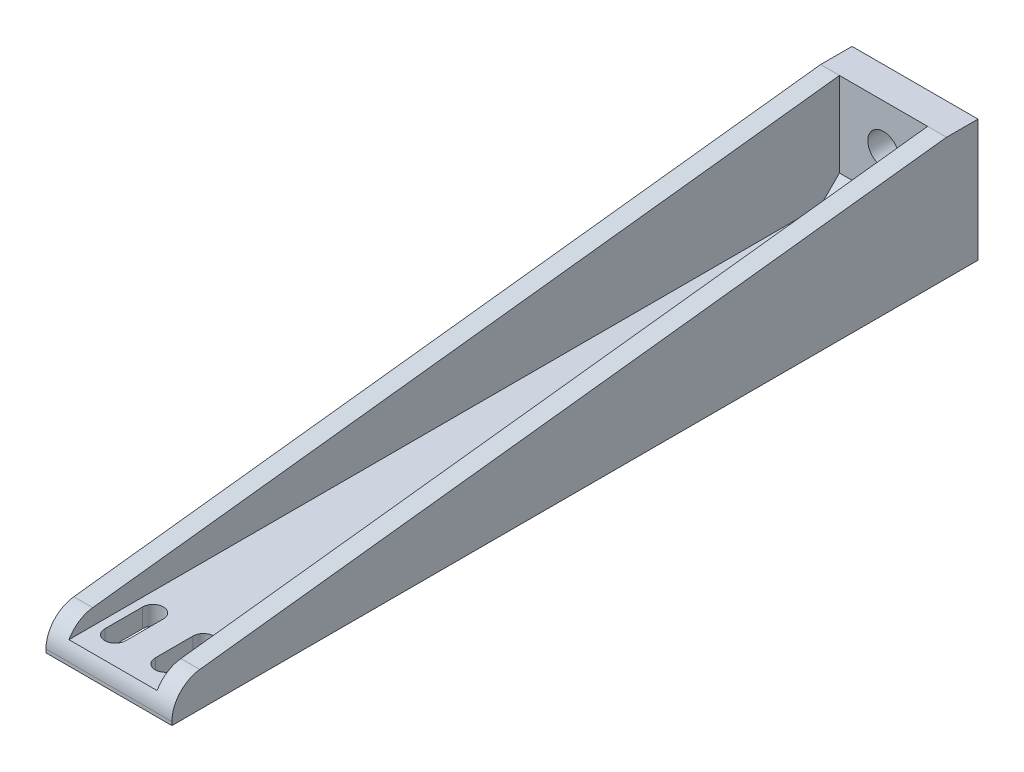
ISO-10303-21;
HEADER;
FILE_DESCRIPTION(('STEP AP214'),'2;1');
FILE_NAME('part.step','',(''),(''),'','','');
FILE_SCHEMA(('AUTOMOTIVE_DESIGN { 1 0 10303 214 1 1 1 1 }'));
ENDSEC;
DATA;
#1=APPLICATION_CONTEXT('core data for automotive mechanical design processes');
#2=APPLICATION_PROTOCOL_DEFINITION('international standard','automotive_design',2000,#1);
#3=PRODUCT_CONTEXT('',#1,'mechanical');
#4=PRODUCT('Part','Part','',(#3));
#5=PRODUCT_RELATED_PRODUCT_CATEGORY('part','',(#4));
#6=PRODUCT_DEFINITION_FORMATION('','',#4);
#7=PRODUCT_DEFINITION_CONTEXT('part definition',#1,'design');
#8=PRODUCT_DEFINITION('design','',#6,#7);
#9=PRODUCT_DEFINITION_SHAPE('','',#8);
#10=(LENGTH_UNIT() NAMED_UNIT(*) SI_UNIT(.MILLI.,.METRE.));
#11=(NAMED_UNIT(*) PLANE_ANGLE_UNIT() SI_UNIT($,.RADIAN.));
#12=(NAMED_UNIT(*) SI_UNIT($,.STERADIAN.) SOLID_ANGLE_UNIT());
#13=UNCERTAINTY_MEASURE_WITH_UNIT(LENGTH_MEASURE(1.E-05),#10,'distance_accuracy_value','');
#14=(GEOMETRIC_REPRESENTATION_CONTEXT(3) GLOBAL_UNCERTAINTY_ASSIGNED_CONTEXT((#13)) GLOBAL_UNIT_ASSIGNED_CONTEXT((#10,
#11,#12)) REPRESENTATION_CONTEXT('',''));
#15=CARTESIAN_POINT('',(0.,0.,0.));
#16=DIRECTION('',(0.,0.,1.));
#17=DIRECTION('',(1.,0.,0.));
#18=AXIS2_PLACEMENT_3D('',#15,#16,#17);
#19=CARTESIAN_POINT('',(20.,4.99999999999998,128.));
#20=DIRECTION('',(0.,-0.993203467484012,-0.116391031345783));
#21=DIRECTION('',(0.,0.116391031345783,-0.993203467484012));
#22=AXIS2_PLACEMENT_3D('',#19,#20,#21);
#23=PLANE('',#22);
#24=DIRECTION('',(0.,-0.116391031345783,0.993203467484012));
#25=VECTOR('',#24,1.);
#26=CARTESIAN_POINT('',(20.,4.99999999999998,128.));
#27=LINE('',#26,#25);
#28=CARTESIAN_POINT('',(20.,19.4140625,5.));
#29=VERTEX_POINT('',#28);
#30=CARTESIAN_POINT('',(20.,5.51773963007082,123.581955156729));
#31=VERTEX_POINT('',#30);
#32=EDGE_CURVE('E492',#29,#31,#27,.T.);
#33=ORIENTED_EDGE('',*,*,#32,.F.);
#34=DIRECTION('',(1.,0.,0.));
#35=VECTOR('',#34,1.);
#36=CARTESIAN_POINT('',(0.,19.4140625,5.));
#37=LINE('',#36,#35);
#38=CARTESIAN_POINT('',(17.,19.4140625,5.));
#39=VERTEX_POINT('',#38);
#40=EDGE_CURVE('E230',#39,#29,#37,.T.);
#41=ORIENTED_EDGE('',*,*,#40,.F.);
#42=DIRECTION('',(0.,-0.116391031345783,0.993203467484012));
#43=VECTOR('',#42,1.);
#44=CARTESIAN_POINT('',(17.,4.99999999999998,128.));
#45=LINE('',#44,#43);
#46=CARTESIAN_POINT('',(17.,5.51773963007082,123.581955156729));
#47=VERTEX_POINT('',#46);
#48=EDGE_CURVE('E255',#39,#47,#45,.T.);
#49=ORIENTED_EDGE('',*,*,#48,.T.);
#50=DIRECTION('',(-1.,0.,0.));
#51=VECTOR('',#50,1.);
#52=CARTESIAN_POINT('',(18.5,5.51773963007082,123.581955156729));
#53=LINE('',#52,#51);
#54=EDGE_CURVE('E281',#47,#31,#53,.F.);
#55=ORIENTED_EDGE('',*,*,#54,.T.);
#56=EDGE_LOOP('',(#33,#41,#49,#55));
#57=FACE_BOUND('',#56,.T.);
#58=ADVANCED_FACE('F49',(#57),#23,.F.);
#59=CARTESIAN_POINT('',(6.99999999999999,28.5143139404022,-3.));
#60=DIRECTION('',(1.,0.,0.));
#61=DIRECTION('',(0.,0.,-1.));
#62=AXIS2_PLACEMENT_3D('',#59,#60,#61);
#63=PLANE('',#62);
#64=DIRECTION('',(0.,0.,-1.));
#65=VECTOR('',#64,1.);
#66=CARTESIAN_POINT('',(7.,7.51087882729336,16.9705627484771));
#67=LINE('',#66,#65);
#68=CARTESIAN_POINT('',(7.,7.51087882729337,0.));
#69=VERTEX_POINT('',#68);
#70=CARTESIAN_POINT('',(6.99999999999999,7.51087882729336,-2.));
#71=VERTEX_POINT('',#70);
#72=EDGE_CURVE('E345',#69,#71,#67,.T.);
#73=ORIENTED_EDGE('',*,*,#72,.T.);
#74=DIRECTION('',(0.,-1.,0.));
#75=VECTOR('',#74,1.);
#76=CARTESIAN_POINT('',(6.99999999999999,28.5143139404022,-2.));
#77=LINE('',#76,#75);
#78=CARTESIAN_POINT('',(6.99999999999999,0.,-2.));
#79=VERTEX_POINT('',#78);
#80=EDGE_CURVE('E315',#71,#79,#77,.T.);
#81=ORIENTED_EDGE('',*,*,#80,.T.);
#82=DIRECTION('',(0.,0.,1.));
#83=VECTOR('',#82,1.);
#84=CARTESIAN_POINT('',(6.99999999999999,0.,-3.));
#85=LINE('',#84,#83);
#86=CARTESIAN_POINT('',(7.,0.,0.));
#87=VERTEX_POINT('',#86);
#88=EDGE_CURVE('E366',#79,#87,#85,.T.);
#89=ORIENTED_EDGE('',*,*,#88,.T.);
#90=DIRECTION('',(0.,1.,0.));
#91=VECTOR('',#90,1.);
#92=CARTESIAN_POINT('',(7.,0.,0.));
#93=LINE('',#92,#91);
#94=EDGE_CURVE('E355',#87,#69,#93,.T.);
#95=ORIENTED_EDGE('',*,*,#94,.T.);
#96=EDGE_LOOP('',(#73,#81,#89,#95));
#97=FACE_BOUND('',#96,.T.);
#98=ADVANCED_FACE('F352',(#97),#63,.F.);
#99=CARTESIAN_POINT('',(20.,0.,0.));
#100=DIRECTION('',(0.,0.,1.));
#101=DIRECTION('',(1.,0.,0.));
#102=AXIS2_PLACEMENT_3D('',#99,#100,#101);
#103=PLANE('',#102);
#104=DIRECTION('',(0.,1.,0.));
#105=VECTOR('',#104,1.);
#106=CARTESIAN_POINT('',(0.,0.,0.));
#107=LINE('',#106,#105);
#108=CARTESIAN_POINT('',(0.,0.,0.));
#109=VERTEX_POINT('',#108);
#110=CARTESIAN_POINT('',(0.,19.4140625,0.));
#111=VERTEX_POINT('',#110);
#112=EDGE_CURVE('E249',#109,#111,#107,.T.);
#113=ORIENTED_EDGE('',*,*,#112,.T.);
#114=DIRECTION('',(1.,0.,0.));
#115=VECTOR('',#114,1.);
#116=CARTESIAN_POINT('',(0.,19.4140625,0.));
#117=LINE('',#116,#115);
#118=CARTESIAN_POINT('',(20.,19.4140625,0.));
#119=VERTEX_POINT('',#118);
#120=EDGE_CURVE('E224',#111,#119,#117,.T.);
#121=ORIENTED_EDGE('',*,*,#120,.T.);
#122=DIRECTION('',(0.,1.,0.));
#123=VECTOR('',#122,1.);
#124=CARTESIAN_POINT('',(20.,0.,0.));
#125=LINE('',#124,#123);
#126=CARTESIAN_POINT('',(20.,0.,0.));
#127=VERTEX_POINT('',#126);
#128=EDGE_CURVE('E262',#127,#119,#125,.T.);
#129=ORIENTED_EDGE('',*,*,#128,.F.);
#130=DIRECTION('',(-1.,0.,0.));
#131=VECTOR('',#130,1.);
#132=CARTESIAN_POINT('',(20.,0.,0.));
#133=LINE('',#132,#131);
#134=CARTESIAN_POINT('',(13.,0.,0.));
#135=VERTEX_POINT('',#134);
#136=EDGE_CURVE('E263',#127,#135,#133,.T.);
#137=ORIENTED_EDGE('',*,*,#136,.T.);
#138=DIRECTION('',(0.,-1.,0.));
#139=VECTOR('',#138,1.);
#140=CARTESIAN_POINT('',(13.,0.,0.));
#141=LINE('',#140,#139);
#142=CARTESIAN_POINT('',(13.,7.51087882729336,0.));
#143=VERTEX_POINT('',#142);
#144=EDGE_CURVE('E374',#143,#135,#141,.T.);
#145=ORIENTED_EDGE('',*,*,#144,.F.);
#146=CARTESIAN_POINT('',(10.,12.70703125,0.));
#147=DIRECTION('',(0.,0.,1.));
#148=DIRECTION('',(1.,0.,0.));
#149=AXIS2_PLACEMENT_3D('',#146,#147,#148);
#150=CIRCLE('',#149,6.);
#151=EDGE_CURVE('E321',#143,#69,#150,.F.);
#152=ORIENTED_EDGE('',*,*,#151,.T.);
#153=ORIENTED_EDGE('',*,*,#94,.F.);
#154=EDGE_CURVE('E268',#87,#109,#133,.T.);
#155=ORIENTED_EDGE('',*,*,#154,.T.);
#156=EDGE_LOOP('',(#113,#121,#129,#137,#145,#152,#153,#155));
#157=FACE_BOUND('',#156,.T.);
#158=CARTESIAN_POINT('',(10.,12.70703125,0.));
#159=DIRECTION('',(0.,0.,1.));
#160=DIRECTION('',(1.,0.,0.));
#161=AXIS2_PLACEMENT_3D('',#158,#159,#160);
#162=CIRCLE('',#161,2.5);
#163=CARTESIAN_POINT('',(12.5,12.70703125,0.));
#164=VERTEX_POINT('',#163);
#165=EDGE_CURVE('E316',#164,#164,#162,.F.);
#166=ORIENTED_EDGE('',*,*,#165,.F.);
#167=EDGE_LOOP('',(#166));
#168=FACE_BOUND('',#167,.T.);
#169=ADVANCED_FACE('F504',(#157,#168),#103,.F.);
#170=DIRECTION('',(0.,0.116391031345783,-0.993203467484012));
#171=VECTOR('',#170,1.);
#172=CARTESIAN_POINT('',(3.,4.99999999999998,128.));
#173=LINE('',#172,#171);
#174=CARTESIAN_POINT('',(3.,5.51773963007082,123.581955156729));
#175=VERTEX_POINT('',#174);
#176=CARTESIAN_POINT('',(2.99999999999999,19.4140625,5.));
#177=VERTEX_POINT('',#176);
#178=EDGE_CURVE('E239',#175,#177,#173,.T.);
#179=ORIENTED_EDGE('',*,*,#178,.T.);
#180=CARTESIAN_POINT('',(0.,19.4140625,5.));
#181=VERTEX_POINT('',#180);
#182=EDGE_CURVE('E221',#181,#177,#37,.T.);
#183=ORIENTED_EDGE('',*,*,#182,.F.);
#184=DIRECTION('',(0.,-0.116391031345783,0.993203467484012));
#185=VECTOR('',#184,1.);
#186=CARTESIAN_POINT('',(0.,4.99999999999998,128.));
#187=LINE('',#186,#185);
#188=CARTESIAN_POINT('',(0.,5.51773963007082,123.581955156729));
#189=VERTEX_POINT('',#188);
#190=EDGE_CURVE('E236',#181,#189,#187,.T.);
#191=ORIENTED_EDGE('',*,*,#190,.T.);
#192=DIRECTION('',(-1.,0.,0.));
#193=VECTOR('',#192,1.);
#194=CARTESIAN_POINT('',(20.,5.51773963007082,123.581955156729));
#195=LINE('',#194,#193);
#196=EDGE_CURVE('E285',#189,#175,#195,.F.);
#197=ORIENTED_EDGE('',*,*,#196,.T.);
#198=EDGE_LOOP('',(#179,#183,#191,#197));
#199=FACE_BOUND('',#198,.T.);
#200=ADVANCED_FACE('F235',(#199),#23,.F.);
#201=CARTESIAN_POINT('',(20.,0.,128.));
#202=DIRECTION('',(0.,0.,-1.));
#203=DIRECTION('',(-1.,0.,0.));
#204=AXIS2_PLACEMENT_3D('',#201,#202,#203);
#205=PLANE('',#204);
#206=DIRECTION('',(0.,-1.,0.));
#207=VECTOR('',#206,1.);
#208=CARTESIAN_POINT('',(20.,0.,128.));
#209=LINE('',#208,#207);
#210=CARTESIAN_POINT('',(20.,0.551722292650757,128.));
#211=VERTEX_POINT('',#210);
#212=CARTESIAN_POINT('',(20.,0.,128.));
#213=VERTEX_POINT('',#212);
#214=EDGE_CURVE('E495',#211,#213,#209,.T.);
#215=ORIENTED_EDGE('',*,*,#214,.F.);
#216=DIRECTION('',(-1.,0.,0.));
#217=VECTOR('',#216,1.);
#218=CARTESIAN_POINT('',(20.,0.551722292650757,128.));
#219=LINE('',#218,#217);
#220=CARTESIAN_POINT('',(0.,0.551722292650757,128.));
#221=VERTEX_POINT('',#220);
#222=EDGE_CURVE('E275',#211,#221,#219,.T.);
#223=ORIENTED_EDGE('',*,*,#222,.T.);
#224=DIRECTION('',(0.,-1.,0.));
#225=VECTOR('',#224,1.);
#226=CARTESIAN_POINT('',(0.,0.,128.));
#227=LINE('',#226,#225);
#228=CARTESIAN_POINT('',(0.,0.,128.));
#229=VERTEX_POINT('',#228);
#230=EDGE_CURVE('E248',#221,#229,#227,.T.);
#231=ORIENTED_EDGE('',*,*,#230,.T.);
#232=DIRECTION('',(-1.,0.,0.));
#233=VECTOR('',#232,1.);
#234=CARTESIAN_POINT('',(20.,0.,128.));
#235=LINE('',#234,#233);
#236=EDGE_CURVE('E267',#213,#229,#235,.T.);
#237=ORIENTED_EDGE('',*,*,#236,.F.);
#238=EDGE_LOOP('',(#215,#223,#231,#237));
#239=FACE_BOUND('',#238,.T.);
#240=ADVANCED_FACE('F510',(#239),#205,.F.);
#241=CARTESIAN_POINT('',(20.,0.,0.));
#242=DIRECTION('',(0.,1.,0.));
#243=DIRECTION('',(0.,0.,1.));
#244=AXIS2_PLACEMENT_3D('',#241,#242,#243);
#245=PLANE('',#244);
#246=ORIENTED_EDGE('',*,*,#88,.F.);
#247=DIRECTION('',(-0.707106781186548,0.,0.707106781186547));
#248=VECTOR('',#247,1.);
#249=CARTESIAN_POINT('',(6.99999999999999,0.,-2.));
#250=LINE('',#249,#248);
#251=CARTESIAN_POINT('',(8.,0.,-3.));
#252=VERTEX_POINT('',#251);
#253=EDGE_CURVE('E328',#79,#252,#250,.F.);
#254=ORIENTED_EDGE('',*,*,#253,.T.);
#255=DIRECTION('',(-1.,0.,0.));
#256=VECTOR('',#255,1.);
#257=CARTESIAN_POINT('',(6.99999999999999,0.,-3.));
#258=LINE('',#257,#256);
#259=CARTESIAN_POINT('',(12.,0.,-3.));
#260=VERTEX_POINT('',#259);
#261=EDGE_CURVE('E364',#260,#252,#258,.T.);
#262=ORIENTED_EDGE('',*,*,#261,.F.);
#263=DIRECTION('',(-0.707106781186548,0.,-0.707106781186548));
#264=VECTOR('',#263,1.);
#265=CARTESIAN_POINT('',(12.,0.,-3.));
#266=LINE('',#265,#264);
#267=CARTESIAN_POINT('',(13.,0.,-2.));
#268=VERTEX_POINT('',#267);
#269=EDGE_CURVE('E325',#260,#268,#266,.F.);
#270=ORIENTED_EDGE('',*,*,#269,.T.);
#271=DIRECTION('',(0.,0.,-1.));
#272=VECTOR('',#271,1.);
#273=CARTESIAN_POINT('',(13.,0.,-3.));
#274=LINE('',#273,#272);
#275=EDGE_CURVE('E370',#135,#268,#274,.T.);
#276=ORIENTED_EDGE('',*,*,#275,.F.);
#277=ORIENTED_EDGE('',*,*,#136,.F.);
#278=DIRECTION('',(0.,0.,-1.));
#279=VECTOR('',#278,1.);
#280=CARTESIAN_POINT('',(20.,0.,0.));
#281=LINE('',#280,#279);
#282=EDGE_CURVE('E497',#213,#127,#281,.T.);
#283=ORIENTED_EDGE('',*,*,#282,.F.);
#284=ORIENTED_EDGE('',*,*,#236,.T.);
#285=DIRECTION('',(0.,0.,-1.));
#286=VECTOR('',#285,1.);
#287=CARTESIAN_POINT('',(0.,0.,0.));
#288=LINE('',#287,#286);
#289=EDGE_CURVE('E253',#229,#109,#288,.T.);
#290=ORIENTED_EDGE('',*,*,#289,.T.);
#291=ORIENTED_EDGE('',*,*,#154,.F.);
#292=EDGE_LOOP('',(#246,#254,#262,#270,#276,#277,#283,#284,#290,#291));
#293=FACE_BOUND('',#292,.T.);
#294=DIRECTION('',(0.,0.,1.));
#295=VECTOR('',#294,1.);
#296=CARTESIAN_POINT('',(12.35,0.,123.));
#297=LINE('',#296,#295);
#298=CARTESIAN_POINT('',(12.35,0.,117.));
#299=VERTEX_POINT('',#298);
#300=CARTESIAN_POINT('',(12.35,0.,123.));
#301=VERTEX_POINT('',#300);
#302=EDGE_CURVE('E434',#299,#301,#297,.T.);
#303=ORIENTED_EDGE('',*,*,#302,.T.);
#304=CARTESIAN_POINT('',(14.,0.,123.));
#305=DIRECTION('',(0.,1.,0.));
#306=DIRECTION('',(0.,0.,1.));
#307=AXIS2_PLACEMENT_3D('',#304,#305,#306);
#308=CIRCLE('',#307,1.65);
#309=CARTESIAN_POINT('',(15.65,0.,123.));
#310=VERTEX_POINT('',#309);
#311=EDGE_CURVE('E448',#301,#310,#308,.T.);
#312=ORIENTED_EDGE('',*,*,#311,.T.);
#313=DIRECTION('',(0.,0.,-1.));
#314=VECTOR('',#313,1.);
#315=CARTESIAN_POINT('',(15.65,0.,123.));
#316=LINE('',#315,#314);
#317=CARTESIAN_POINT('',(15.65,0.,117.));
#318=VERTEX_POINT('',#317);
#319=EDGE_CURVE('E465',#310,#318,#316,.T.);
#320=ORIENTED_EDGE('',*,*,#319,.T.);
#321=CARTESIAN_POINT('',(14.,0.,117.));
#322=DIRECTION('',(0.,1.,0.));
#323=DIRECTION('',(0.,0.,1.));
#324=AXIS2_PLACEMENT_3D('',#321,#322,#323);
#325=CIRCLE('',#324,1.65000000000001);
#326=EDGE_CURVE('E461',#318,#299,#325,.T.);
#327=ORIENTED_EDGE('',*,*,#326,.T.);
#328=EDGE_LOOP('',(#303,#312,#320,#327));
#329=FACE_BOUND('',#328,.T.);
#330=DIRECTION('',(0.,0.,1.));
#331=VECTOR('',#330,1.);
#332=CARTESIAN_POINT('',(4.35,0.,123.));
#333=LINE('',#332,#331);
#334=CARTESIAN_POINT('',(4.35,0.,117.));
#335=VERTEX_POINT('',#334);
#336=CARTESIAN_POINT('',(4.35,0.,123.));
#337=VERTEX_POINT('',#336);
#338=EDGE_CURVE('E397',#335,#337,#333,.T.);
#339=ORIENTED_EDGE('',*,*,#338,.T.);
#340=CARTESIAN_POINT('',(6.,0.,123.));
#341=DIRECTION('',(0.,1.,0.));
#342=DIRECTION('',(0.,0.,1.));
#343=AXIS2_PLACEMENT_3D('',#340,#341,#342);
#344=CIRCLE('',#343,1.65);
#345=CARTESIAN_POINT('',(7.65,0.,123.));
#346=VERTEX_POINT('',#345);
#347=EDGE_CURVE('E384',#337,#346,#344,.T.);
#348=ORIENTED_EDGE('',*,*,#347,.T.);
#349=DIRECTION('',(0.,0.,-1.));
#350=VECTOR('',#349,1.);
#351=CARTESIAN_POINT('',(7.65,0.,123.));
#352=LINE('',#351,#350);
#353=CARTESIAN_POINT('',(7.65000000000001,0.,117.));
#354=VERTEX_POINT('',#353);
#355=EDGE_CURVE('E388',#346,#354,#352,.T.);
#356=ORIENTED_EDGE('',*,*,#355,.T.);
#357=CARTESIAN_POINT('',(6.,0.,117.));
#358=DIRECTION('',(0.,1.,0.));
#359=DIRECTION('',(0.,0.,1.));
#360=AXIS2_PLACEMENT_3D('',#357,#358,#359);
#361=CIRCLE('',#360,1.65000000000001);
#362=EDGE_CURVE('E393',#354,#335,#361,.T.);
#363=ORIENTED_EDGE('',*,*,#362,.T.);
#364=EDGE_LOOP('',(#339,#348,#356,#363));
#365=FACE_BOUND('',#364,.T.);
#366=ADVANCED_FACE('F362',(#293,#329,#365),#245,.F.);
#367=CARTESIAN_POINT('',(20.,0.,0.));
#368=DIRECTION('',(1.,0.,0.));
#369=DIRECTION('',(0.,0.,-1.));
#370=AXIS2_PLACEMENT_3D('',#367,#368,#369);
#371=PLANE('',#370);
#372=DIRECTION('',(0.,0.,-1.));
#373=VECTOR('',#372,1.);
#374=CARTESIAN_POINT('',(20.,19.4140625,0.));
#375=LINE('',#374,#373);
#376=EDGE_CURVE('E231',#29,#119,#375,.T.);
#377=ORIENTED_EDGE('',*,*,#376,.F.);
#378=ORIENTED_EDGE('',*,*,#32,.T.);
#379=CARTESIAN_POINT('',(20.,0.551722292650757,123.));
#380=DIRECTION('',(1.,0.,0.));
#381=DIRECTION('',(0.,0.,-1.));
#382=AXIS2_PLACEMENT_3D('',#379,#380,#381);
#383=CIRCLE('',#382,5.);
#384=EDGE_CURVE('E299',#31,#211,#383,.T.);
#385=ORIENTED_EDGE('',*,*,#384,.T.);
#386=ORIENTED_EDGE('',*,*,#214,.T.);
#387=ORIENTED_EDGE('',*,*,#282,.T.);
#388=ORIENTED_EDGE('',*,*,#128,.T.);
#389=EDGE_LOOP('',(#377,#378,#385,#386,#387,#388));
#390=FACE_BOUND('',#389,.T.);
#391=ADVANCED_FACE('F563',(#390),#371,.T.);
#392=CARTESIAN_POINT('',(0.,0.,0.));
#393=DIRECTION('',(1.,0.,0.));
#394=DIRECTION('',(0.,0.,-1.));
#395=AXIS2_PLACEMENT_3D('',#392,#393,#394);
#396=PLANE('',#395);
#397=ORIENTED_EDGE('',*,*,#190,.F.);
#398=DIRECTION('',(0.,0.,-1.));
#399=VECTOR('',#398,1.);
#400=CARTESIAN_POINT('',(0.,19.4140625,0.));
#401=LINE('',#400,#399);
#402=EDGE_CURVE('E218',#181,#111,#401,.T.);
#403=ORIENTED_EDGE('',*,*,#402,.T.);
#404=ORIENTED_EDGE('',*,*,#112,.F.);
#405=ORIENTED_EDGE('',*,*,#289,.F.);
#406=ORIENTED_EDGE('',*,*,#230,.F.);
#407=CARTESIAN_POINT('',(0.,0.551722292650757,123.));
#408=DIRECTION('',(1.,0.,0.));
#409=DIRECTION('',(0.,0.,-1.));
#410=AXIS2_PLACEMENT_3D('',#407,#408,#409);
#411=CIRCLE('',#410,5.);
#412=EDGE_CURVE('E245',#221,#189,#411,.F.);
#413=ORIENTED_EDGE('',*,*,#412,.T.);
#414=EDGE_LOOP('',(#397,#403,#404,#405,#406,#413));
#415=FACE_BOUND('',#414,.T.);
#416=ADVANCED_FACE('F243',(#415),#396,.F.);
#417=CARTESIAN_POINT('',(20.,0.,5.));
#418=DIRECTION('',(0.,0.,1.));
#419=DIRECTION('',(1.,0.,0.));
#420=AXIS2_PLACEMENT_3D('',#417,#418,#419);
#421=PLANE('',#420);
#422=CARTESIAN_POINT('',(10.,12.70703125,5.));
#423=DIRECTION('',(0.,0.,1.));
#424=DIRECTION('',(1.,0.,0.));
#425=AXIS2_PLACEMENT_3D('',#422,#423,#424);
#426=CIRCLE('',#425,2.5);
#427=CARTESIAN_POINT('',(12.5,12.70703125,5.));
#428=VERTEX_POINT('',#427);
#429=EDGE_CURVE('E357',#428,#428,#426,.T.);
#430=ORIENTED_EDGE('',*,*,#429,.F.);
#431=EDGE_LOOP('',(#430));
#432=FACE_BOUND('',#431,.T.);
#433=DIRECTION('',(0.,1.,0.));
#434=VECTOR('',#433,1.);
#435=CARTESIAN_POINT('',(3.,4.99999999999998,5.));
#436=LINE('',#435,#434);
#437=CARTESIAN_POINT('',(3.,5.99999999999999,5.));
#438=VERTEX_POINT('',#437);
#439=EDGE_CURVE('E476',#438,#177,#436,.T.);
#440=ORIENTED_EDGE('',*,*,#439,.F.);
#441=DIRECTION('',(1.,0.,0.));
#442=VECTOR('',#441,1.);
#443=CARTESIAN_POINT('',(20.,5.99999999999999,5.));
#444=LINE('',#443,#442);
#445=CARTESIAN_POINT('',(17.,5.99999999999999,5.));
#446=VERTEX_POINT('',#445);
#447=EDGE_CURVE('E309',#438,#446,#444,.T.);
#448=ORIENTED_EDGE('',*,*,#447,.T.);
#449=DIRECTION('',(0.,-1.,0.));
#450=VECTOR('',#449,1.);
#451=CARTESIAN_POINT('',(17.,4.99999999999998,5.));
#452=LINE('',#451,#450);
#453=EDGE_CURVE('E472',#39,#446,#452,.T.);
#454=ORIENTED_EDGE('',*,*,#453,.F.);
#455=DIRECTION('',(-1.,0.,0.));
#456=VECTOR('',#455,1.);
#457=CARTESIAN_POINT('',(20.,19.4140625,5.));
#458=LINE('',#457,#456);
#459=EDGE_CURVE('E272',#39,#177,#458,.T.);
#460=ORIENTED_EDGE('',*,*,#459,.T.);
#461=EDGE_LOOP('',(#440,#448,#454,#460));
#462=FACE_BOUND('',#461,.T.);
#463=ADVANCED_FACE('F524',(#432,#462),#421,.T.);
#464=CARTESIAN_POINT('',(17.,4.99999999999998,-22.0227155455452));
#465=DIRECTION('',(1.,0.,0.));
#466=DIRECTION('',(0.,0.,-1.));
#467=AXIS2_PLACEMENT_3D('',#464,#465,#466);
#468=PLANE('',#467);
#469=ORIENTED_EDGE('',*,*,#453,.T.);
#470=DIRECTION('',(0.,-0.707106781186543,0.707106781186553));
#471=VECTOR('',#470,1.);
#472=CARTESIAN_POINT('',(17.,3.,8.00000000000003));
#473=LINE('',#472,#471);
#474=CARTESIAN_POINT('',(17.,3.,8.00000000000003));
#475=VERTEX_POINT('',#474);
#476=EDGE_CURVE('E312',#446,#475,#473,.T.);
#477=ORIENTED_EDGE('',*,*,#476,.T.);
#478=DIRECTION('',(0.,0.,1.));
#479=VECTOR('',#478,1.);
#480=CARTESIAN_POINT('',(17.,3.,-22.0227155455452));
#481=LINE('',#480,#479);
#482=CARTESIAN_POINT('',(17.,3.,127.359579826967));
#483=VERTEX_POINT('',#482);
#484=EDGE_CURVE('E477',#475,#483,#481,.T.);
#485=ORIENTED_EDGE('',*,*,#484,.T.);
#486=CARTESIAN_POINT('',(17.,0.551722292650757,123.));
#487=DIRECTION('',(1.,0.,0.));
#488=DIRECTION('',(0.,0.,-1.));
#489=AXIS2_PLACEMENT_3D('',#486,#487,#488);
#490=CIRCLE('',#489,5.);
#491=EDGE_CURVE('E296',#483,#47,#490,.F.);
#492=ORIENTED_EDGE('',*,*,#491,.T.);
#493=ORIENTED_EDGE('',*,*,#48,.F.);
#494=EDGE_LOOP('',(#469,#477,#485,#492,#493));
#495=FACE_BOUND('',#494,.T.);
#496=ADVANCED_FACE('F532',(#495),#468,.F.);
#497=CARTESIAN_POINT('',(3.,4.99999999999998,-22.0227155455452));
#498=DIRECTION('',(-1.,0.,0.));
#499=DIRECTION('',(0.,-1.,0.));
#500=AXIS2_PLACEMENT_3D('',#497,#498,#499);
#501=PLANE('',#500);
#502=DIRECTION('',(0.,0.,1.));
#503=VECTOR('',#502,1.);
#504=CARTESIAN_POINT('',(3.,3.,-22.0227155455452));
#505=LINE('',#504,#503);
#506=CARTESIAN_POINT('',(3.,3.,8.00000000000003));
#507=VERTEX_POINT('',#506);
#508=CARTESIAN_POINT('',(3.,3.,127.359579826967));
#509=VERTEX_POINT('',#508);
#510=EDGE_CURVE('E420',#507,#509,#505,.T.);
#511=ORIENTED_EDGE('',*,*,#510,.F.);
#512=DIRECTION('',(0.,0.707106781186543,-0.707106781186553));
#513=VECTOR('',#512,1.);
#514=CARTESIAN_POINT('',(3.,3.,8.00000000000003));
#515=LINE('',#514,#513);
#516=EDGE_CURVE('E306',#507,#438,#515,.T.);
#517=ORIENTED_EDGE('',*,*,#516,.T.);
#518=ORIENTED_EDGE('',*,*,#439,.T.);
#519=ORIENTED_EDGE('',*,*,#178,.F.);
#520=CARTESIAN_POINT('',(3.,0.551722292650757,123.));
#521=DIRECTION('',(-1.,0.,0.));
#522=DIRECTION('',(0.,-1.,0.));
#523=AXIS2_PLACEMENT_3D('',#520,#521,#522);
#524=CIRCLE('',#523,5.);
#525=EDGE_CURVE('E288',#175,#509,#524,.F.);
#526=ORIENTED_EDGE('',*,*,#525,.T.);
#527=EDGE_LOOP('',(#511,#517,#518,#519,#526));
#528=FACE_BOUND('',#527,.T.);
#529=ADVANCED_FACE('F520',(#528),#501,.F.);
#530=CARTESIAN_POINT('',(3.,3.,-22.0227155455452));
#531=DIRECTION('',(0.,-1.,0.));
#532=DIRECTION('',(0.,0.,-1.));
#533=AXIS2_PLACEMENT_3D('',#530,#531,#532);
#534=PLANE('',#533);
#535=DIRECTION('',(0.,0.,-1.));
#536=VECTOR('',#535,1.);
#537=CARTESIAN_POINT('',(7.65,3.,123.));
#538=LINE('',#537,#536);
#539=CARTESIAN_POINT('',(7.65,3.,123.));
#540=VERTEX_POINT('',#539);
#541=CARTESIAN_POINT('',(7.65000000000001,3.,117.));
#542=VERTEX_POINT('',#541);
#543=EDGE_CURVE('E405',#540,#542,#538,.T.);
#544=ORIENTED_EDGE('',*,*,#543,.F.);
#545=CARTESIAN_POINT('',(6.,3.,123.));
#546=DIRECTION('',(0.,1.,0.));
#547=DIRECTION('',(0.,0.,1.));
#548=AXIS2_PLACEMENT_3D('',#545,#546,#547);
#549=CIRCLE('',#548,1.65);
#550=CARTESIAN_POINT('',(4.35,3.,123.));
#551=VERTEX_POINT('',#550);
#552=EDGE_CURVE('E402',#551,#540,#549,.T.);
#553=ORIENTED_EDGE('',*,*,#552,.F.);
#554=DIRECTION('',(0.,0.,1.));
#555=VECTOR('',#554,1.);
#556=CARTESIAN_POINT('',(4.35,3.,123.));
#557=LINE('',#556,#555);
#558=CARTESIAN_POINT('',(4.35,3.,117.));
#559=VERTEX_POINT('',#558);
#560=EDGE_CURVE('E389',#559,#551,#557,.T.);
#561=ORIENTED_EDGE('',*,*,#560,.F.);
#562=CARTESIAN_POINT('',(6.,3.,117.));
#563=DIRECTION('',(0.,1.,0.));
#564=DIRECTION('',(0.,0.,1.));
#565=AXIS2_PLACEMENT_3D('',#562,#563,#564);
#566=CIRCLE('',#565,1.65000000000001);
#567=EDGE_CURVE('E410',#542,#559,#566,.T.);
#568=ORIENTED_EDGE('',*,*,#567,.F.);
#569=EDGE_LOOP('',(#544,#553,#561,#568));
#570=FACE_BOUND('',#569,.T.);
#571=DIRECTION('',(0.,0.,-1.));
#572=VECTOR('',#571,1.);
#573=CARTESIAN_POINT('',(15.65,3.,123.));
#574=LINE('',#573,#572);
#575=CARTESIAN_POINT('',(15.65,3.,123.));
#576=VERTEX_POINT('',#575);
#577=CARTESIAN_POINT('',(15.65,3.,117.));
#578=VERTEX_POINT('',#577);
#579=EDGE_CURVE('E452',#576,#578,#574,.T.);
#580=ORIENTED_EDGE('',*,*,#579,.F.);
#581=CARTESIAN_POINT('',(14.,3.,123.));
#582=DIRECTION('',(0.,1.,0.));
#583=DIRECTION('',(0.,0.,1.));
#584=AXIS2_PLACEMENT_3D('',#581,#582,#583);
#585=CIRCLE('',#584,1.65);
#586=CARTESIAN_POINT('',(12.35,3.,123.));
#587=VERTEX_POINT('',#586);
#588=EDGE_CURVE('E406',#587,#576,#585,.T.);
#589=ORIENTED_EDGE('',*,*,#588,.F.);
#590=DIRECTION('',(0.,0.,1.));
#591=VECTOR('',#590,1.);
#592=CARTESIAN_POINT('',(12.35,3.,123.));
#593=LINE('',#592,#591);
#594=CARTESIAN_POINT('',(12.35,3.,117.));
#595=VERTEX_POINT('',#594);
#596=EDGE_CURVE('E443',#595,#587,#593,.T.);
#597=ORIENTED_EDGE('',*,*,#596,.F.);
#598=CARTESIAN_POINT('',(14.,3.,117.));
#599=DIRECTION('',(0.,1.,0.));
#600=DIRECTION('',(0.,0.,1.));
#601=AXIS2_PLACEMENT_3D('',#598,#599,#600);
#602=CIRCLE('',#601,1.65000000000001);
#603=EDGE_CURVE('E447',#578,#595,#602,.T.);
#604=ORIENTED_EDGE('',*,*,#603,.F.);
#605=EDGE_LOOP('',(#580,#589,#597,#604));
#606=FACE_BOUND('',#605,.T.);
#607=ORIENTED_EDGE('',*,*,#484,.F.);
#608=DIRECTION('',(-1.,0.,0.));
#609=VECTOR('',#608,1.);
#610=CARTESIAN_POINT('',(3.,3.,8.00000000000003));
#611=LINE('',#610,#609);
#612=EDGE_CURVE('E302',#475,#507,#611,.T.);
#613=ORIENTED_EDGE('',*,*,#612,.T.);
#614=ORIENTED_EDGE('',*,*,#510,.T.);
#615=DIRECTION('',(-1.,0.,0.));
#616=VECTOR('',#615,1.);
#617=CARTESIAN_POINT('',(3.,3.,127.359579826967));
#618=LINE('',#617,#616);
#619=EDGE_CURVE('E292',#509,#483,#618,.F.);
#620=ORIENTED_EDGE('',*,*,#619,.T.);
#621=EDGE_LOOP('',(#607,#613,#614,#620));
#622=FACE_BOUND('',#621,.T.);
#623=ADVANCED_FACE('F535',(#570,#606,#622),#534,.F.);
#624=CARTESIAN_POINT('',(20.,0.551722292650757,123.));
#625=DIRECTION('',(-1.,0.,0.));
#626=DIRECTION('',(0.,0.,1.));
#627=AXIS2_PLACEMENT_3D('',#624,#625,#626);
#628=CYLINDRICAL_SURFACE('',#627,5.);
#629=ORIENTED_EDGE('',*,*,#525,.F.);
#630=ORIENTED_EDGE('',*,*,#196,.F.);
#631=ORIENTED_EDGE('',*,*,#412,.F.);
#632=ORIENTED_EDGE('',*,*,#222,.F.);
#633=ORIENTED_EDGE('',*,*,#384,.F.);
#634=ORIENTED_EDGE('',*,*,#54,.F.);
#635=ORIENTED_EDGE('',*,*,#491,.F.);
#636=ORIENTED_EDGE('',*,*,#619,.F.);
#637=EDGE_LOOP('',(#629,#630,#631,#632,#633,#634,#635,#636));
#638=FACE_BOUND('',#637,.T.);
#639=ADVANCED_FACE('F515',(#638),#628,.T.);
#640=CARTESIAN_POINT('',(14.,0.,123.));
#641=DIRECTION('',(0.,1.,0.));
#642=DIRECTION('',(0.,0.,1.));
#643=AXIS2_PLACEMENT_3D('',#640,#641,#642);
#644=CYLINDRICAL_SURFACE('',#643,1.65);
#645=ORIENTED_EDGE('',*,*,#588,.T.);
#646=DIRECTION('',(0.,1.,0.));
#647=VECTOR('',#646,1.);
#648=CARTESIAN_POINT('',(15.65,0.,123.));
#649=LINE('',#648,#647);
#650=EDGE_CURVE('E430',#310,#576,#649,.T.);
#651=ORIENTED_EDGE('',*,*,#650,.F.);
#652=ORIENTED_EDGE('',*,*,#311,.F.);
#653=DIRECTION('',(0.,1.,0.));
#654=VECTOR('',#653,1.);
#655=CARTESIAN_POINT('',(12.35,0.,123.));
#656=LINE('',#655,#654);
#657=EDGE_CURVE('E383',#301,#587,#656,.T.);
#658=ORIENTED_EDGE('',*,*,#657,.T.);
#659=EDGE_LOOP('',(#645,#651,#652,#658));
#660=FACE_BOUND('',#659,.T.);
#661=ADVANCED_FACE('F586',(#660),#644,.F.);
#662=CARTESIAN_POINT('',(12.35,0.,123.));
#663=DIRECTION('',(-1.,0.,0.));
#664=DIRECTION('',(0.,0.,1.));
#665=AXIS2_PLACEMENT_3D('',#662,#663,#664);
#666=PLANE('',#665);
#667=ORIENTED_EDGE('',*,*,#596,.T.);
#668=ORIENTED_EDGE('',*,*,#657,.F.);
#669=ORIENTED_EDGE('',*,*,#302,.F.);
#670=DIRECTION('',(0.,1.,0.));
#671=VECTOR('',#670,1.);
#672=CARTESIAN_POINT('',(12.35,0.,117.));
#673=LINE('',#672,#671);
#674=EDGE_CURVE('E438',#299,#595,#673,.T.);
#675=ORIENTED_EDGE('',*,*,#674,.T.);
#676=EDGE_LOOP('',(#667,#668,#669,#675));
#677=FACE_BOUND('',#676,.T.);
#678=ADVANCED_FACE('F633',(#677),#666,.F.);
#679=CARTESIAN_POINT('',(14.,0.,117.));
#680=DIRECTION('',(0.,1.,0.));
#681=DIRECTION('',(0.,0.,1.));
#682=AXIS2_PLACEMENT_3D('',#679,#680,#681);
#683=CYLINDRICAL_SURFACE('',#682,1.65000000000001);
#684=ORIENTED_EDGE('',*,*,#603,.T.);
#685=ORIENTED_EDGE('',*,*,#674,.F.);
#686=ORIENTED_EDGE('',*,*,#326,.F.);
#687=DIRECTION('',(0.,1.,0.));
#688=VECTOR('',#687,1.);
#689=CARTESIAN_POINT('',(15.65,0.,117.));
#690=LINE('',#689,#688);
#691=EDGE_CURVE('E435',#318,#578,#690,.T.);
#692=ORIENTED_EDGE('',*,*,#691,.T.);
#693=EDGE_LOOP('',(#684,#685,#686,#692));
#694=FACE_BOUND('',#693,.T.);
#695=ADVANCED_FACE('F637',(#694),#683,.F.);
#696=CARTESIAN_POINT('',(15.65,0.,123.));
#697=DIRECTION('',(1.,0.,0.));
#698=DIRECTION('',(0.,0.,-1.));
#699=AXIS2_PLACEMENT_3D('',#696,#697,#698);
#700=PLANE('',#699);
#701=ORIENTED_EDGE('',*,*,#579,.T.);
#702=ORIENTED_EDGE('',*,*,#691,.F.);
#703=ORIENTED_EDGE('',*,*,#319,.F.);
#704=ORIENTED_EDGE('',*,*,#650,.T.);
#705=EDGE_LOOP('',(#701,#702,#703,#704));
#706=FACE_BOUND('',#705,.T.);
#707=ADVANCED_FACE('F629',(#706),#700,.F.);
#708=CARTESIAN_POINT('',(6.,0.,123.));
#709=DIRECTION('',(0.,1.,0.));
#710=DIRECTION('',(0.,0.,1.));
#711=AXIS2_PLACEMENT_3D('',#708,#709,#710);
#712=CYLINDRICAL_SURFACE('',#711,1.65);
#713=ORIENTED_EDGE('',*,*,#552,.T.);
#714=DIRECTION('',(0.,1.,0.));
#715=VECTOR('',#714,1.);
#716=CARTESIAN_POINT('',(7.65,0.,123.));
#717=LINE('',#716,#715);
#718=EDGE_CURVE('E401',#346,#540,#717,.T.);
#719=ORIENTED_EDGE('',*,*,#718,.F.);
#720=ORIENTED_EDGE('',*,*,#347,.F.);
#721=DIRECTION('',(0.,1.,0.));
#722=VECTOR('',#721,1.);
#723=CARTESIAN_POINT('',(4.35,0.,123.));
#724=LINE('',#723,#722);
#725=EDGE_CURVE('E417',#337,#551,#724,.T.);
#726=ORIENTED_EDGE('',*,*,#725,.T.);
#727=EDGE_LOOP('',(#713,#719,#720,#726));
#728=FACE_BOUND('',#727,.T.);
#729=ADVANCED_FACE('F619',(#728),#712,.F.);
#730=CARTESIAN_POINT('',(4.35,0.,123.));
#731=DIRECTION('',(-1.,0.,0.));
#732=DIRECTION('',(0.,0.,1.));
#733=AXIS2_PLACEMENT_3D('',#730,#731,#732);
#734=PLANE('',#733);
#735=ORIENTED_EDGE('',*,*,#560,.T.);
#736=ORIENTED_EDGE('',*,*,#725,.F.);
#737=ORIENTED_EDGE('',*,*,#338,.F.);
#738=DIRECTION('',(0.,1.,0.));
#739=VECTOR('',#738,1.);
#740=CARTESIAN_POINT('',(4.35,0.,117.));
#741=LINE('',#740,#739);
#742=EDGE_CURVE('E421',#335,#559,#741,.T.);
#743=ORIENTED_EDGE('',*,*,#742,.T.);
#744=EDGE_LOOP('',(#735,#736,#737,#743));
#745=FACE_BOUND('',#744,.T.);
#746=ADVANCED_FACE('F615',(#745),#734,.F.);
#747=CARTESIAN_POINT('',(6.,0.,117.));
#748=DIRECTION('',(0.,1.,0.));
#749=DIRECTION('',(0.,0.,1.));
#750=AXIS2_PLACEMENT_3D('',#747,#748,#749);
#751=CYLINDRICAL_SURFACE('',#750,1.65000000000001);
#752=ORIENTED_EDGE('',*,*,#567,.T.);
#753=ORIENTED_EDGE('',*,*,#742,.F.);
#754=ORIENTED_EDGE('',*,*,#362,.F.);
#755=DIRECTION('',(0.,1.,0.));
#756=VECTOR('',#755,1.);
#757=CARTESIAN_POINT('',(7.65000000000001,0.,117.));
#758=LINE('',#757,#756);
#759=EDGE_CURVE('E424',#354,#542,#758,.T.);
#760=ORIENTED_EDGE('',*,*,#759,.T.);
#761=EDGE_LOOP('',(#752,#753,#754,#760));
#762=FACE_BOUND('',#761,.T.);
#763=ADVANCED_FACE('F618',(#762),#751,.F.);
#764=CARTESIAN_POINT('',(7.65,0.,123.));
#765=DIRECTION('',(1.,0.,0.));
#766=DIRECTION('',(0.,0.,-1.));
#767=AXIS2_PLACEMENT_3D('',#764,#765,#766);
#768=PLANE('',#767);
#769=ORIENTED_EDGE('',*,*,#543,.T.);
#770=ORIENTED_EDGE('',*,*,#759,.F.);
#771=ORIENTED_EDGE('',*,*,#355,.F.);
#772=ORIENTED_EDGE('',*,*,#718,.T.);
#773=EDGE_LOOP('',(#769,#770,#771,#772));
#774=FACE_BOUND('',#773,.T.);
#775=ADVANCED_FACE('F593',(#774),#768,.F.);
#776=CARTESIAN_POINT('',(3.,3.,8.00000000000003));
#777=DIRECTION('',(0.,-0.707106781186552,-0.707106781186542));
#778=DIRECTION('',(-1.,0.,0.));
#779=AXIS2_PLACEMENT_3D('',#776,#777,#778);
#780=PLANE('',#779);
#781=ORIENTED_EDGE('',*,*,#476,.F.);
#782=ORIENTED_EDGE('',*,*,#447,.F.);
#783=ORIENTED_EDGE('',*,*,#516,.F.);
#784=ORIENTED_EDGE('',*,*,#612,.F.);
#785=EDGE_LOOP('',(#781,#782,#783,#784));
#786=FACE_BOUND('',#785,.T.);
#787=ADVANCED_FACE('F528',(#786),#780,.F.);
#788=CARTESIAN_POINT('',(13.,28.5143139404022,-3.));
#789=DIRECTION('',(-1.,0.,0.));
#790=DIRECTION('',(0.,0.,1.));
#791=AXIS2_PLACEMENT_3D('',#788,#789,#790);
#792=PLANE('',#791);
#793=ORIENTED_EDGE('',*,*,#275,.T.);
#794=DIRECTION('',(0.,1.,0.));
#795=VECTOR('',#794,1.);
#796=CARTESIAN_POINT('',(13.,28.5143139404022,-2.));
#797=LINE('',#796,#795);
#798=CARTESIAN_POINT('',(13.,7.51087882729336,-2.));
#799=VERTEX_POINT('',#798);
#800=EDGE_CURVE('E12',#268,#799,#797,.T.);
#801=ORIENTED_EDGE('',*,*,#800,.T.);
#802=DIRECTION('',(0.,0.,-1.));
#803=VECTOR('',#802,1.);
#804=CARTESIAN_POINT('',(13.,7.51087882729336,16.9705627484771));
#805=LINE('',#804,#803);
#806=EDGE_CURVE('E320',#799,#143,#805,.F.);
#807=ORIENTED_EDGE('',*,*,#806,.T.);
#808=ORIENTED_EDGE('',*,*,#144,.T.);
#809=EDGE_LOOP('',(#793,#801,#807,#808));
#810=FACE_BOUND('',#809,.T.);
#811=ADVANCED_FACE('F592',(#810),#792,.F.);
#812=CARTESIAN_POINT('',(6.99999999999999,28.5143139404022,-3.));
#813=DIRECTION('',(0.,0.,1.));
#814=DIRECTION('',(1.,0.,0.));
#815=AXIS2_PLACEMENT_3D('',#812,#813,#814);
#816=PLANE('',#815);
#817=ORIENTED_EDGE('',*,*,#261,.T.);
#818=DIRECTION('',(0.,1.,0.));
#819=VECTOR('',#818,1.);
#820=CARTESIAN_POINT('',(8.,28.5143139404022,-3.));
#821=LINE('',#820,#819);
#822=CARTESIAN_POINT('',(8.,7.05017700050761,-3.));
#823=VERTEX_POINT('',#822);
#824=EDGE_CURVE('E72',#252,#823,#821,.T.);
#825=ORIENTED_EDGE('',*,*,#824,.T.);
#826=CARTESIAN_POINT('',(10.,12.70703125,-3.));
#827=DIRECTION('',(0.,0.,-1.));
#828=DIRECTION('',(-1.,0.,0.));
#829=AXIS2_PLACEMENT_3D('',#826,#827,#828);
#830=CIRCLE('',#829,6.);
#831=CARTESIAN_POINT('',(12.,7.05017700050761,-3.));
#832=VERTEX_POINT('',#831);
#833=EDGE_CURVE('E347',#832,#823,#830,.T.);
#834=ORIENTED_EDGE('',*,*,#833,.F.);
#835=DIRECTION('',(0.,-1.,0.));
#836=VECTOR('',#835,1.);
#837=CARTESIAN_POINT('',(12.,28.5143139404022,-3.));
#838=LINE('',#837,#836);
#839=EDGE_CURVE('E331',#832,#260,#838,.T.);
#840=ORIENTED_EDGE('',*,*,#839,.T.);
#841=EDGE_LOOP('',(#817,#825,#834,#840));
#842=FACE_BOUND('',#841,.T.);
#843=ADVANCED_FACE('F367',(#842),#816,.F.);
#844=CARTESIAN_POINT('',(10.,12.70703125,-3.));
#845=DIRECTION('',(0.,0.,1.));
#846=DIRECTION('',(1.,0.,0.));
#847=AXIS2_PLACEMENT_3D('',#844,#845,#846);
#848=CYLINDRICAL_SURFACE('',#847,2.5);
#849=ORIENTED_EDGE('',*,*,#165,.T.);
#850=EDGE_LOOP('',(#849));
#851=FACE_BOUND('',#850,.T.);
#852=ORIENTED_EDGE('',*,*,#429,.T.);
#853=EDGE_LOOP('',(#852));
#854=FACE_BOUND('',#853,.T.);
#855=ADVANCED_FACE('F554',(#851,#854),#848,.F.);
#856=CARTESIAN_POINT('',(10.,12.70703125,16.9705627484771));
#857=DIRECTION('',(0.,0.,-1.));
#858=DIRECTION('',(-1.,0.,0.));
#859=AXIS2_PLACEMENT_3D('',#856,#857,#858);
#860=CYLINDRICAL_SURFACE('',#859,6.);
#861=ORIENTED_EDGE('',*,*,#833,.T.);
#862=CARTESIAN_POINT('',(10.,12.70703125,-5.));
#863=DIRECTION('',(0.707106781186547,0.,0.707106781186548));
#864=DIRECTION('',(0.707106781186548,0.,-0.707106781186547));
#865=AXIS2_PLACEMENT_3D('',#862,#863,#864);
#866=ELLIPSE('',#865,8.48528137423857,6.);
#867=EDGE_CURVE('E59',#823,#71,#866,.F.);
#868=ORIENTED_EDGE('',*,*,#867,.T.);
#869=ORIENTED_EDGE('',*,*,#72,.F.);
#870=ORIENTED_EDGE('',*,*,#151,.F.);
#871=ORIENTED_EDGE('',*,*,#806,.F.);
#872=CARTESIAN_POINT('',(10.,12.70703125,-5.));
#873=DIRECTION('',(-0.707106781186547,0.,0.707106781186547));
#874=DIRECTION('',(-0.707106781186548,0.,-0.707106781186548));
#875=AXIS2_PLACEMENT_3D('',#872,#873,#874);
#876=ELLIPSE('',#875,8.48528137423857,6.);
#877=EDGE_CURVE('E337',#799,#832,#876,.F.);
#878=ORIENTED_EDGE('',*,*,#877,.T.);
#879=EDGE_LOOP('',(#861,#868,#869,#870,#871,#878));
#880=FACE_BOUND('',#879,.T.);
#881=ADVANCED_FACE('F343',(#880),#860,.F.);
#882=CARTESIAN_POINT('',(0.,19.4140625,0.));
#883=DIRECTION('',(0.,-1.,0.));
#884=DIRECTION('',(0.,0.,-1.));
#885=AXIS2_PLACEMENT_3D('',#882,#883,#884);
#886=PLANE('',#885);
#887=ORIENTED_EDGE('',*,*,#376,.T.);
#888=ORIENTED_EDGE('',*,*,#120,.F.);
#889=ORIENTED_EDGE('',*,*,#402,.F.);
#890=ORIENTED_EDGE('',*,*,#182,.T.);
#891=ORIENTED_EDGE('',*,*,#459,.F.);
#892=ORIENTED_EDGE('',*,*,#40,.T.);
#893=EDGE_LOOP('',(#887,#888,#889,#890,#891,#892));
#894=FACE_BOUND('',#893,.T.);
#895=ADVANCED_FACE('F220',(#894),#886,.F.);
#896=CARTESIAN_POINT('',(6.99999999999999,28.5143139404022,-2.));
#897=DIRECTION('',(0.707106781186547,0.,0.707106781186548));
#898=DIRECTION('',(0.,-1.,0.));
#899=AXIS2_PLACEMENT_3D('',#896,#897,#898);
#900=PLANE('',#899);
#901=ORIENTED_EDGE('',*,*,#867,.F.);
#902=ORIENTED_EDGE('',*,*,#824,.F.);
#903=ORIENTED_EDGE('',*,*,#253,.F.);
#904=ORIENTED_EDGE('',*,*,#80,.F.);
#905=EDGE_LOOP('',(#901,#902,#903,#904));
#906=FACE_BOUND('',#905,.T.);
#907=ADVANCED_FACE('F359',(#906),#900,.F.);
#908=CARTESIAN_POINT('',(12.,28.5143139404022,-3.));
#909=DIRECTION('',(-0.707106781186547,0.,0.707106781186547));
#910=DIRECTION('',(0.,-1.,0.));
#911=AXIS2_PLACEMENT_3D('',#908,#909,#910);
#912=PLANE('',#911);
#913=ORIENTED_EDGE('',*,*,#877,.F.);
#914=ORIENTED_EDGE('',*,*,#800,.F.);
#915=ORIENTED_EDGE('',*,*,#269,.F.);
#916=ORIENTED_EDGE('',*,*,#839,.F.);
#917=EDGE_LOOP('',(#913,#914,#915,#916));
#918=FACE_BOUND('',#917,.T.);
#919=ADVANCED_FACE('F52',(#918),#912,.F.);
#920=CLOSED_SHELL('',(#58,#98,#169,#200,#240,#366,#391,#416,#463,#496,#529,#623,#639,#661,#678,
#695,#707,#729,#746,#763,#775,#787,#811,#843,#855,#881,#895,#907,#919));
#921=MANIFOLD_SOLID_BREP('B2',#920);
#922=ADVANCED_BREP_SHAPE_REPRESENTATION('',(#18,#921),#14);
#923=SHAPE_DEFINITION_REPRESENTATION(#9,#922);
ENDSEC;
END-ISO-10303-21;
